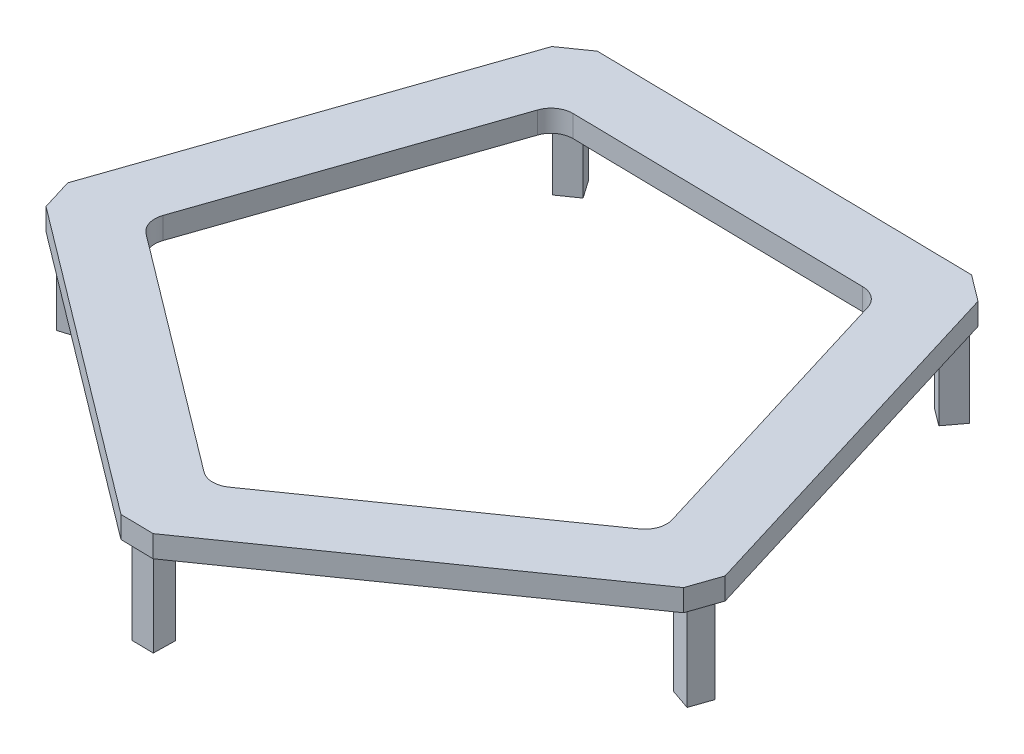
ISO-10303-21;
HEADER;
FILE_DESCRIPTION(('STEP AP214'),'2;1');
FILE_NAME('part.step','',(''),(''),'','','');
FILE_SCHEMA(('AUTOMOTIVE_DESIGN { 1 0 10303 214 1 1 1 1 }'));
ENDSEC;
DATA;
#1=APPLICATION_CONTEXT('core data for automotive mechanical design processes');
#2=APPLICATION_PROTOCOL_DEFINITION('international standard','automotive_design',2000,#1);
#3=PRODUCT_CONTEXT('',#1,'mechanical');
#4=PRODUCT('Part','Part','',(#3));
#5=PRODUCT_RELATED_PRODUCT_CATEGORY('part','',(#4));
#6=PRODUCT_DEFINITION_FORMATION('','',#4);
#7=PRODUCT_DEFINITION_CONTEXT('part definition',#1,'design');
#8=PRODUCT_DEFINITION('design','',#6,#7);
#9=PRODUCT_DEFINITION_SHAPE('','',#8);
#10=(LENGTH_UNIT() NAMED_UNIT(*) SI_UNIT(.MILLI.,.METRE.));
#11=(NAMED_UNIT(*) PLANE_ANGLE_UNIT() SI_UNIT($,.RADIAN.));
#12=(NAMED_UNIT(*) SI_UNIT($,.STERADIAN.) SOLID_ANGLE_UNIT());
#13=UNCERTAINTY_MEASURE_WITH_UNIT(LENGTH_MEASURE(1.E-05),#10,'distance_accuracy_value','');
#14=(GEOMETRIC_REPRESENTATION_CONTEXT(3) GLOBAL_UNCERTAINTY_ASSIGNED_CONTEXT((#13)) GLOBAL_UNIT_ASSIGNED_CONTEXT((#10,
#11,#12)) REPRESENTATION_CONTEXT('',''));
#15=CARTESIAN_POINT('',(0.,0.,0.));
#16=DIRECTION('',(0.,0.,1.));
#17=DIRECTION('',(1.,0.,0.));
#18=AXIS2_PLACEMENT_3D('',#15,#16,#17);
#19=CARTESIAN_POINT('',(0.,0.,0.));
#20=DIRECTION('',(0.,-1.,0.));
#21=DIRECTION('',(0.,0.,-1.));
#22=AXIS2_PLACEMENT_3D('',#19,#20,#21);
#23=PLANE('',#22);
#24=DIRECTION('',(-0.601815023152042,0.,0.798635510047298));
#25=VECTOR('',#24,1.);
#26=CARTESIAN_POINT('',(62.3425402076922,0.,-77.4556377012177));
#27=LINE('',#26,#25);
#28=CARTESIAN_POINT('',(62.3425402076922,0.,-77.4556377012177));
#29=VERTEX_POINT('',#28);
#30=CARTESIAN_POINT('',(58.5210148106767,0.,-72.3843022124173));
#31=VERTEX_POINT('',#30);
#32=EDGE_CURVE('E318',#29,#31,#27,.T.);
#33=ORIENTED_EDGE('',*,*,#32,.F.);
#34=DIRECTION('',(0.798635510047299,0.,0.60181502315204));
#35=VECTOR('',#34,1.);
#36=CARTESIAN_POINT('',(57.2712047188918,0.,-81.2771630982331));
#37=LINE('',#36,#35);
#38=CARTESIAN_POINT('',(57.2712047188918,0.,-81.2771630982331));
#39=VERTEX_POINT('',#38);
#40=EDGE_CURVE('E315',#39,#29,#37,.T.);
#41=ORIENTED_EDGE('',*,*,#40,.F.);
#42=DIRECTION('',(0.601815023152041,0.,-0.798635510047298));
#43=VECTOR('',#42,1.);
#44=CARTESIAN_POINT('',(57.2712047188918,0.,-81.2771630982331));
#45=LINE('',#44,#43);
#46=CARTESIAN_POINT('',(53.4496793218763,0.,-76.2058276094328));
#47=VERTEX_POINT('',#46);
#48=EDGE_CURVE('E328',#47,#39,#45,.T.);
#49=ORIENTED_EDGE('',*,*,#48,.F.);
#50=DIRECTION('',(-0.798635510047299,0.,-0.60181502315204));
#51=VECTOR('',#50,1.);
#52=CARTESIAN_POINT('',(53.4496793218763,0.,-76.2058276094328));
#53=LINE('',#52,#51);
#54=EDGE_CURVE('E336',#31,#47,#53,.T.);
#55=ORIENTED_EDGE('',*,*,#54,.F.);
#56=EDGE_LOOP('',(#33,#41,#49,#55));
#57=FACE_BOUND('',#56,.T.);
#58=DIRECTION('',(0.292371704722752,0.,0.956304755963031));
#59=VECTOR('',#58,1.);
#60=CARTESIAN_POINT('',(-89.8909208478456,0.,24.1623411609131));
#61=LINE('',#60,#59);
#62=CARTESIAN_POINT('',(-89.8909208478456,0.,24.1623411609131));
#63=VERTEX_POINT('',#62);
#64=CARTESIAN_POINT('',(-88.0343605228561,0.,30.2348763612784));
#65=VERTEX_POINT('',#64);
#66=EDGE_CURVE('E392',#63,#65,#61,.T.);
#67=ORIENTED_EDGE('',*,*,#66,.F.);
#68=DIRECTION('',(0.956304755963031,0.,-0.292371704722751));
#69=VECTOR('',#68,1.);
#70=CARTESIAN_POINT('',(-95.9634560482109,0.,26.0189014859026));
#71=LINE('',#70,#69);
#72=CARTESIAN_POINT('',(-95.9634560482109,0.,26.0189014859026));
#73=VERTEX_POINT('',#72);
#74=EDGE_CURVE('E378',#73,#63,#71,.T.);
#75=ORIENTED_EDGE('',*,*,#74,.F.);
#76=DIRECTION('',(-0.292371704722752,0.,-0.956304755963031));
#77=VECTOR('',#76,1.);
#78=CARTESIAN_POINT('',(-95.9634560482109,0.,26.0189014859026));
#79=LINE('',#78,#77);
#80=CARTESIAN_POINT('',(-94.1068957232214,0.,32.0914366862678));
#81=VERTEX_POINT('',#80);
#82=EDGE_CURVE('E383',#81,#73,#79,.T.);
#83=ORIENTED_EDGE('',*,*,#82,.F.);
#84=DIRECTION('',(-0.956304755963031,0.,0.292371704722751));
#85=VECTOR('',#84,1.);
#86=CARTESIAN_POINT('',(-94.1068957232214,0.,32.0914366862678));
#87=LINE('',#86,#85);
#88=EDGE_CURVE('E394',#65,#81,#87,.T.);
#89=ORIENTED_EDGE('',*,*,#88,.F.);
#90=EDGE_LOOP('',(#67,#75,#83,#89));
#91=FACE_BOUND('',#90,.T.);
#92=DIRECTION('',(0.819152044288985,0.,-0.573576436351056));
#93=VECTOR('',#92,1.);
#94=CARTESIAN_POINT('',(93.9137646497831,0.,37.374020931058));
#95=LINE('',#94,#93);
#96=CARTESIAN_POINT('',(2.99969243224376,0.,101.032739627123));
#97=VERTEX_POINT('',#96);
#98=CARTESIAN_POINT('',(93.9137646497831,0.,37.374020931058));
#99=VERTEX_POINT('',#98);
#100=EDGE_CURVE('E436',#97,#99,#95,.T.);
#101=ORIENTED_EDGE('',*,*,#100,.F.);
#102=DIRECTION('',(0.999847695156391,0.,0.017452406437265));
#103=VECTOR('',#102,1.);
#104=CARTESIAN_POINT('',(2.99969243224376,0.,101.032739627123));
#105=LINE('',#104,#103);
#106=CARTESIAN_POINT('',(-6.52385686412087,0.,100.866505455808));
#107=VERTEX_POINT('',#106);
#108=EDGE_CURVE('E441',#107,#97,#105,.T.);
#109=ORIENTED_EDGE('',*,*,#108,.F.);
#110=DIRECTION('',(0.798635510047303,0.,0.601815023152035));
#111=VECTOR('',#110,1.);
#112=CARTESIAN_POINT('',(-6.52385686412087,0.,100.866505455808));
#113=LINE('',#112,#111);
#114=CARTESIAN_POINT('',(-95.1608894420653,0.,34.0737105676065));
#115=VERTEX_POINT('',#114);
#116=EDGE_CURVE('E476',#115,#107,#113,.T.);
#117=ORIENTED_EDGE('',*,*,#116,.F.);
#118=DIRECTION('',(0.292371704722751,0.,0.956304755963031));
#119=VECTOR('',#118,1.);
#120=CARTESIAN_POINT('',(-95.1608894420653,0.,34.0737105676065));
#121=LINE('',#120,#119);
#122=CARTESIAN_POINT('',(-97.9457299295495,0.,24.9649077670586));
#123=VERTEX_POINT('',#122);
#124=EDGE_CURVE('E474',#123,#115,#121,.T.);
#125=ORIENTED_EDGE('',*,*,#124,.F.);
#126=DIRECTION('',(-0.325568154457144,0.,0.945518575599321));
#127=VECTOR('',#126,1.);
#128=CARTESIAN_POINT('',(-97.9457299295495,0.,24.9649077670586));
#129=LINE('',#128,#127);
#130=CARTESIAN_POINT('',(-61.8123565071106,0.,-79.9740283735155));
#131=VERTEX_POINT('',#130);
#132=EDGE_CURVE('E472',#131,#123,#129,.T.);
#133=ORIENTED_EDGE('',*,*,#132,.F.);
#134=DIRECTION('',(-0.819152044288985,0.,0.573576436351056));
#135=VECTOR('',#134,1.);
#136=CARTESIAN_POINT('',(-61.8123565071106,0.,-79.9740283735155));
#137=LINE('',#136,#135);
#138=CARTESIAN_POINT('',(-54.0099332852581,0.,-85.4373439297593));
#139=VERTEX_POINT('',#138);
#140=EDGE_CURVE('E470',#139,#131,#137,.T.);
#141=ORIENTED_EDGE('',*,*,#140,.F.);
#142=DIRECTION('',(-0.999847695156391,0.,-0.017452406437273));
#143=VECTOR('',#142,1.);
#144=CARTESIAN_POINT('',(-54.0099332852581,0.,-85.4373439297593));
#145=LINE('',#144,#143);
#146=CARTESIAN_POINT('',(56.9587521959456,0.,-83.5003783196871));
#147=VERTEX_POINT('',#146);
#148=EDGE_CURVE('E468',#147,#139,#145,.T.);
#149=ORIENTED_EDGE('',*,*,#148,.F.);
#150=DIRECTION('',(-0.798635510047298,0.,-0.601815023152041));
#151=VECTOR('',#150,1.);
#152=CARTESIAN_POINT('',(56.9587521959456,0.,-83.5003783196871));
#153=LINE('',#152,#151);
#154=CARTESIAN_POINT('',(64.5657554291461,0.,-77.7680902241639));
#155=VERTEX_POINT('',#154);
#156=EDGE_CURVE('E466',#155,#147,#153,.T.);
#157=ORIENTED_EDGE('',*,*,#156,.F.);
#158=DIRECTION('',(-0.292371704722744,0.,-0.956304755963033));
#159=VECTOR('',#158,1.);
#160=CARTESIAN_POINT('',(64.5657554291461,0.,-77.7680902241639));
#161=LINE('',#160,#159);
#162=CARTESIAN_POINT('',(97.0148013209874,0.,28.3679564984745));
#163=VERTEX_POINT('',#162);
#164=EDGE_CURVE('E464',#163,#155,#161,.T.);
#165=ORIENTED_EDGE('',*,*,#164,.F.);
#166=DIRECTION('',(0.32556815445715,0.,-0.945518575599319));
#167=VECTOR('',#166,1.);
#168=CARTESIAN_POINT('',(97.0148013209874,0.,28.3679564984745));
#169=LINE('',#168,#167);
#170=EDGE_CURVE('E462',#99,#163,#169,.T.);
#171=ORIENTED_EDGE('',*,*,#170,.F.);
#172=EDGE_LOOP('',(#101,#109,#117,#125,#133,#141,#149,#157,#165,#171));
#173=FACE_BOUND('',#172,.T.);
#174=DIRECTION('',(0.999847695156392,0.,0.0174524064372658));
#175=VECTOR('',#174,1.);
#176=CARTESIAN_POINT('',(-4.79807017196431,0.,92.9579200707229));
#177=LINE('',#176,#175);
#178=CARTESIAN_POINT('',(-4.79807017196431,0.,92.9579200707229));
#179=VERTEX_POINT('',#178);
#180=CARTESIAN_POINT('',(1.55096269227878,0.,93.0687428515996));
#181=VERTEX_POINT('',#180);
#182=EDGE_CURVE('E421',#179,#181,#177,.T.);
#183=ORIENTED_EDGE('',*,*,#182,.F.);
#184=DIRECTION('',(0.0174524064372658,0.,-0.999847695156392));
#185=VECTOR('',#184,1.);
#186=CARTESIAN_POINT('',(-4.90889295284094,0.,99.306952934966));
#187=LINE('',#186,#185);
#188=CARTESIAN_POINT('',(-4.90889295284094,0.,99.306952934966));
#189=VERTEX_POINT('',#188);
#190=EDGE_CURVE('E407',#189,#179,#187,.T.);
#191=ORIENTED_EDGE('',*,*,#190,.F.);
#192=DIRECTION('',(-0.999847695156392,0.,-0.0174524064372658));
#193=VECTOR('',#192,1.);
#194=CARTESIAN_POINT('',(-4.90889295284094,0.,99.306952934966));
#195=LINE('',#194,#193);
#196=CARTESIAN_POINT('',(1.44013991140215,0.,99.4177757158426));
#197=VERTEX_POINT('',#196);
#198=EDGE_CURVE('E412',#197,#189,#195,.T.);
#199=ORIENTED_EDGE('',*,*,#198,.F.);
#200=DIRECTION('',(-0.0174524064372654,0.,0.999847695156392));
#201=VECTOR('',#200,1.);
#202=CARTESIAN_POINT('',(1.44013991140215,0.,99.4177757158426));
#203=LINE('',#202,#201);
#204=EDGE_CURVE('E423',#181,#197,#203,.T.);
#205=ORIENTED_EDGE('',*,*,#204,.F.);
#206=EDGE_LOOP('',(#183,#191,#199,#205));
#207=FACE_BOUND('',#206,.T.);
#208=DIRECTION('',(0.573576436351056,0.,0.819152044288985));
#209=VECTOR('',#208,1.);
#210=CARTESIAN_POINT('',(-54.3997845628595,0.,-83.2263874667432));
#211=LINE('',#210,#209);
#212=CARTESIAN_POINT('',(-54.3997845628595,0.,-83.2263874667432));
#213=VERTEX_POINT('',#212);
#214=CARTESIAN_POINT('',(-50.7575741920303,0.,-78.0247719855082));
#215=VERTEX_POINT('',#214);
#216=EDGE_CURVE('E363',#213,#215,#211,.T.);
#217=ORIENTED_EDGE('',*,*,#216,.F.);
#218=DIRECTION('',(0.819152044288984,0.,-0.573576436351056));
#219=VECTOR('',#218,1.);
#220=CARTESIAN_POINT('',(-54.3997845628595,0.,-83.2263874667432));
#221=LINE('',#220,#219);
#222=CARTESIAN_POINT('',(-59.6014000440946,0.,-79.584177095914));
#223=VERTEX_POINT('',#222);
#224=EDGE_CURVE('E349',#223,#213,#221,.T.);
#225=ORIENTED_EDGE('',*,*,#224,.F.);
#226=DIRECTION('',(-0.573576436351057,0.,-0.819152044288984));
#227=VECTOR('',#226,1.);
#228=CARTESIAN_POINT('',(-59.6014000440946,0.,-79.584177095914));
#229=LINE('',#228,#227);
#230=CARTESIAN_POINT('',(-55.9591896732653,0.,-74.3825616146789));
#231=VERTEX_POINT('',#230);
#232=EDGE_CURVE('E354',#231,#223,#229,.T.);
#233=ORIENTED_EDGE('',*,*,#232,.F.);
#234=DIRECTION('',(-0.819152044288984,0.,0.573576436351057));
#235=VECTOR('',#234,1.);
#236=CARTESIAN_POINT('',(-50.7575741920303,0.,-78.0247719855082));
#237=LINE('',#236,#235);
#238=EDGE_CURVE('E365',#215,#231,#237,.T.);
#239=ORIENTED_EDGE('',*,*,#238,.F.);
#240=EDGE_LOOP('',(#217,#225,#233,#239));
#241=FACE_BOUND('',#240,.T.);
#242=DIRECTION('',(0.945518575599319,0.,0.32556815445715));
#243=VECTOR('',#242,1.);
#244=CARTESIAN_POINT('',(88.9929081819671,0.,27.2847700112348));
#245=LINE('',#244,#243);
#246=CARTESIAN_POINT('',(88.9929081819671,0.,27.2847700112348));
#247=VERTEX_POINT('',#246);
#248=CARTESIAN_POINT('',(94.9969511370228,0.,29.3521277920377));
#249=VERTEX_POINT('',#248);
#250=EDGE_CURVE('E588',#247,#249,#245,.T.);
#251=ORIENTED_EDGE('',*,*,#250,.F.);
#252=DIRECTION('',(0.325568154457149,0.,-0.945518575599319));
#253=VECTOR('',#252,1.);
#254=CARTESIAN_POINT('',(88.9929081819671,0.,27.2847700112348));
#255=LINE('',#254,#253);
#256=CARTESIAN_POINT('',(86.9255504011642,0.,33.2888129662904));
#257=VERTEX_POINT('',#256);
#258=EDGE_CURVE('E313',#257,#247,#255,.T.);
#259=ORIENTED_EDGE('',*,*,#258,.F.);
#260=DIRECTION('',(-0.945518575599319,0.,-0.32556815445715));
#261=VECTOR('',#260,1.);
#262=CARTESIAN_POINT('',(86.9255504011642,0.,33.2888129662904));
#263=LINE('',#262,#261);
#264=CARTESIAN_POINT('',(92.9295933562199,0.,35.3561707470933));
#265=VERTEX_POINT('',#264);
#266=EDGE_CURVE('E309',#265,#257,#263,.T.);
#267=ORIENTED_EDGE('',*,*,#266,.F.);
#268=DIRECTION('',(-0.32556815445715,0.,0.945518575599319));
#269=VECTOR('',#268,1.);
#270=CARTESIAN_POINT('',(94.9969511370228,0.,29.3521277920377));
#271=LINE('',#270,#269);
#272=EDGE_CURVE('E590',#249,#265,#271,.T.);
#273=ORIENTED_EDGE('',*,*,#272,.F.);
#274=EDGE_LOOP('',(#251,#259,#267,#273));
#275=FACE_BOUND('',#274,.T.);
#276=DIRECTION('',(-0.999847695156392,0.,-0.0174524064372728));
#277=VECTOR('',#276,1.);
#278=CARTESIAN_POINT('',(48.6736338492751,0.,-64.5920937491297));
#279=LINE('',#278,#277);
#280=CARTESIAN_POINT('',(44.0607914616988,0.,-64.6726112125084));
#281=VERTEX_POINT('',#280);
#282=CARTESIAN_POINT('',(-41.7769092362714,0.,-66.1709138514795));
#283=VERTEX_POINT('',#282);
#284=EDGE_CURVE('E564',#281,#283,#279,.T.);
#285=ORIENTED_EDGE('',*,*,#284,.T.);
#286=CARTESIAN_POINT('',(-41.8877320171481,0.,-59.8218809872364));
#287=DIRECTION('',(0.,-1.,0.));
#288=DIRECTION('',(0.,0.,-1.));
#289=AXIS2_PLACEMENT_3D('',#286,#287,#288);
#290=CIRCLE('',#289,6.35);
#291=CARTESIAN_POINT('',(-47.8917749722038,0.,-61.8892387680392));
#292=VERTEX_POINT('',#291);
#293=EDGE_CURVE('E11',#283,#292,#290,.F.);
#294=ORIENTED_EDGE('',*,*,#293,.T.);
#295=DIRECTION('',(-0.325568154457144,0.,0.945518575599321));
#296=VECTOR('',#295,1.);
#297=CARTESIAN_POINT('',(-46.3897516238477,0.,-66.2514313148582));
#298=LINE('',#297,#296);
#299=CARTESIAN_POINT('',(-75.8420537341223,0.,19.2842648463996));
#300=VERTEX_POINT('',#299);
#301=EDGE_CURVE('E562',#292,#300,#298,.T.);
#302=ORIENTED_EDGE('',*,*,#301,.T.);
#303=CARTESIAN_POINT('',(-69.8380107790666,0.,21.3516226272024));
#304=DIRECTION('',(0.,-1.,0.));
#305=DIRECTION('',(0.,0.,-1.));
#306=AXIS2_PLACEMENT_3D('',#303,#304,#305);
#307=CIRCLE('',#306,6.35);
#308=CARTESIAN_POINT('',(-73.659536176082,0.,26.4229581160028));
#309=VERTEX_POINT('',#308);
#310=EDGE_CURVE('E545',#300,#309,#307,.F.);
#311=ORIENTED_EDGE('',*,*,#310,.T.);
#312=DIRECTION('',(0.798635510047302,0.,0.601815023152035));
#313=VECTOR('',#312,1.);
#314=CARTESIAN_POINT('',(-77.3440770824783,0.,23.6464573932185));
#315=LINE('',#314,#313);
#316=CARTESIAN_POINT('',(-5.0960577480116,0.,78.0892449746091));
#317=VERTEX_POINT('',#316);
#318=EDGE_CURVE('E568',#309,#317,#315,.T.);
#319=ORIENTED_EDGE('',*,*,#318,.T.);
#320=CARTESIAN_POINT('',(-1.27453235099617,0.,73.0179094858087));
#321=DIRECTION('',(0.,-1.,0.));
#322=DIRECTION('',(0.,0.,-1.));
#323=AXIS2_PLACEMENT_3D('',#320,#321,#322);
#324=CIRCLE('',#323,6.35);
#325=CARTESIAN_POINT('',(2.36767801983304,0.,78.2195249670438));
#326=VERTEX_POINT('',#325);
#327=EDGE_CURVE('E538',#317,#326,#324,.F.);
#328=ORIENTED_EDGE('',*,*,#327,.T.);
#329=DIRECTION('',(0.819152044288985,0.,-0.573576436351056));
#330=VECTOR('',#329,1.);
#331=CARTESIAN_POINT('',(-1.41151684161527,0.,80.8657456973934));
#332=LINE('',#331,#330);
#333=CARTESIAN_POINT('',(72.6925168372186,0.,28.9775427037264));
#334=VERTEX_POINT('',#333);
#335=EDGE_CURVE('E572',#326,#334,#332,.T.);
#336=ORIENTED_EDGE('',*,*,#335,.T.);
#337=CARTESIAN_POINT('',(69.0503064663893,0.,23.7759272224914));
#338=DIRECTION('',(0.,-1.,0.));
#339=DIRECTION('',(0.,0.,-1.));
#340=AXIS2_PLACEMENT_3D('',#337,#338,#339);
#341=CIRCLE('',#340,6.35);
#342=CARTESIAN_POINT('',(75.1228416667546,0.,21.9193668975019));
#343=VERTEX_POINT('',#342);
#344=EDGE_CURVE('E542',#334,#343,#341,.F.);
#345=ORIENTED_EDGE('',*,*,#344,.T.);
#346=DIRECTION('',(-0.292371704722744,0.,-0.956304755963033));
#347=VECTOR('',#346,1.);
#348=CARTESIAN_POINT('',(76.4717116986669,0.,26.3313219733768));
#349=LINE('',#348,#347);
#350=CARTESIAN_POINT('',(50.0225038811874,0.,-60.1801386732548));
#351=VERTEX_POINT('',#350);
#352=EDGE_CURVE('E579',#343,#351,#349,.T.);
#353=ORIENTED_EDGE('',*,*,#352,.T.);
#354=CARTESIAN_POINT('',(43.9499686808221,0.,-58.3235783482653));
#355=DIRECTION('',(0.,-1.,0.));
#356=DIRECTION('',(0.,0.,-1.));
#357=AXIS2_PLACEMENT_3D('',#354,#355,#356);
#358=CIRCLE('',#357,6.35);
#359=EDGE_CURVE('E534',#351,#281,#358,.F.);
#360=ORIENTED_EDGE('',*,*,#359,.T.);
#361=EDGE_LOOP('',(#285,#294,#302,#311,#319,#328,#336,#345,#353,#360));
#362=FACE_BOUND('',#361,.T.);
#363=ADVANCED_FACE('F33',(#57,#91,#173,#207,#241,#275,#362),#23,.T.);
#364=CARTESIAN_POINT('',(0.,6.35,0.));
#365=DIRECTION('',(0.,-1.,0.));
#366=DIRECTION('',(0.,0.,-1.));
#367=AXIS2_PLACEMENT_3D('',#364,#365,#366);
#368=PLANE('',#367);
#369=DIRECTION('',(0.819152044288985,0.,-0.573576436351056));
#370=VECTOR('',#369,1.);
#371=CARTESIAN_POINT('',(93.9137646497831,6.35,37.374020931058));
#372=LINE('',#371,#370);
#373=CARTESIAN_POINT('',(2.99969243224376,6.35,101.032739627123));
#374=VERTEX_POINT('',#373);
#375=CARTESIAN_POINT('',(93.9137646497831,6.35,37.374020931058));
#376=VERTEX_POINT('',#375);
#377=EDGE_CURVE('E437',#374,#376,#372,.T.);
#378=ORIENTED_EDGE('',*,*,#377,.T.);
#379=DIRECTION('',(0.32556815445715,0.,-0.945518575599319));
#380=VECTOR('',#379,1.);
#381=CARTESIAN_POINT('',(97.0148013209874,6.35,28.3679564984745));
#382=LINE('',#381,#380);
#383=CARTESIAN_POINT('',(97.0148013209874,6.35,28.3679564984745));
#384=VERTEX_POINT('',#383);
#385=EDGE_CURVE('E440',#376,#384,#382,.T.);
#386=ORIENTED_EDGE('',*,*,#385,.T.);
#387=DIRECTION('',(-0.292371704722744,0.,-0.956304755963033));
#388=VECTOR('',#387,1.);
#389=CARTESIAN_POINT('',(64.5657554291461,6.35,-77.7680902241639));
#390=LINE('',#389,#388);
#391=CARTESIAN_POINT('',(64.5657554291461,6.35,-77.7680902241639));
#392=VERTEX_POINT('',#391);
#393=EDGE_CURVE('E443',#384,#392,#390,.T.);
#394=ORIENTED_EDGE('',*,*,#393,.T.);
#395=DIRECTION('',(-0.798635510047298,0.,-0.601815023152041));
#396=VECTOR('',#395,1.);
#397=CARTESIAN_POINT('',(56.9587521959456,6.35,-83.5003783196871));
#398=LINE('',#397,#396);
#399=CARTESIAN_POINT('',(56.9587521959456,6.35,-83.5003783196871));
#400=VERTEX_POINT('',#399);
#401=EDGE_CURVE('E445',#392,#400,#398,.T.);
#402=ORIENTED_EDGE('',*,*,#401,.T.);
#403=DIRECTION('',(-0.999847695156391,0.,-0.017452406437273));
#404=VECTOR('',#403,1.);
#405=CARTESIAN_POINT('',(-54.0099332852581,6.35,-85.4373439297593));
#406=LINE('',#405,#404);
#407=CARTESIAN_POINT('',(-54.0099332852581,6.35,-85.4373439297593));
#408=VERTEX_POINT('',#407);
#409=EDGE_CURVE('E447',#400,#408,#406,.T.);
#410=ORIENTED_EDGE('',*,*,#409,.T.);
#411=DIRECTION('',(-0.819152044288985,0.,0.573576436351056));
#412=VECTOR('',#411,1.);
#413=CARTESIAN_POINT('',(-61.8123565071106,6.35,-79.9740283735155));
#414=LINE('',#413,#412);
#415=CARTESIAN_POINT('',(-61.8123565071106,6.35,-79.9740283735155));
#416=VERTEX_POINT('',#415);
#417=EDGE_CURVE('E449',#408,#416,#414,.T.);
#418=ORIENTED_EDGE('',*,*,#417,.T.);
#419=DIRECTION('',(-0.325568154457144,0.,0.945518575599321));
#420=VECTOR('',#419,1.);
#421=CARTESIAN_POINT('',(-97.9457299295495,6.35,24.9649077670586));
#422=LINE('',#421,#420);
#423=CARTESIAN_POINT('',(-97.9457299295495,6.35,24.9649077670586));
#424=VERTEX_POINT('',#423);
#425=EDGE_CURVE('E451',#416,#424,#422,.T.);
#426=ORIENTED_EDGE('',*,*,#425,.T.);
#427=DIRECTION('',(0.292371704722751,0.,0.956304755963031));
#428=VECTOR('',#427,1.);
#429=CARTESIAN_POINT('',(-95.1608894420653,6.35,34.0737105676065));
#430=LINE('',#429,#428);
#431=CARTESIAN_POINT('',(-95.1608894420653,6.35,34.0737105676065));
#432=VERTEX_POINT('',#431);
#433=EDGE_CURVE('E453',#424,#432,#430,.T.);
#434=ORIENTED_EDGE('',*,*,#433,.T.);
#435=DIRECTION('',(0.798635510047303,0.,0.601815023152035));
#436=VECTOR('',#435,1.);
#437=CARTESIAN_POINT('',(-6.52385686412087,6.35,100.866505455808));
#438=LINE('',#437,#436);
#439=CARTESIAN_POINT('',(-6.52385686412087,6.35,100.866505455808));
#440=VERTEX_POINT('',#439);
#441=EDGE_CURVE('E455',#432,#440,#438,.T.);
#442=ORIENTED_EDGE('',*,*,#441,.T.);
#443=DIRECTION('',(0.999847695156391,0.,0.017452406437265));
#444=VECTOR('',#443,1.);
#445=CARTESIAN_POINT('',(2.99969243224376,6.35,101.032739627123));
#446=LINE('',#445,#444);
#447=EDGE_CURVE('E457',#440,#374,#446,.T.);
#448=ORIENTED_EDGE('',*,*,#447,.T.);
#449=EDGE_LOOP('',(#378,#386,#394,#402,#410,#418,#426,#434,#442,#448));
#450=FACE_BOUND('',#449,.T.);
#451=DIRECTION('',(0.798635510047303,0.,0.601815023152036));
#452=VECTOR('',#451,1.);
#453=CARTESIAN_POINT('',(-77.3440770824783,6.35,23.6464573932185));
#454=LINE('',#453,#452);
#455=CARTESIAN_POINT('',(-73.659536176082,6.35,26.4229581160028));
#456=VERTEX_POINT('',#455);
#457=CARTESIAN_POINT('',(-5.09605774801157,6.35,78.0892449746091));
#458=VERTEX_POINT('',#457);
#459=EDGE_CURVE('E680',#456,#458,#454,.T.);
#460=ORIENTED_EDGE('',*,*,#459,.F.);
#461=CARTESIAN_POINT('',(-69.8380107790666,6.34999999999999,21.3516226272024));
#462=DIRECTION('',(0.,-1.,0.));
#463=DIRECTION('',(0.,0.,-1.));
#464=AXIS2_PLACEMENT_3D('',#461,#462,#463);
#465=CIRCLE('',#464,6.35);
#466=CARTESIAN_POINT('',(-75.8420537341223,6.35,19.2842648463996));
#467=VERTEX_POINT('',#466);
#468=EDGE_CURVE('E48',#456,#467,#465,.T.);
#469=ORIENTED_EDGE('',*,*,#468,.T.);
#470=DIRECTION('',(-0.325568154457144,0.,0.945518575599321));
#471=VECTOR('',#470,1.);
#472=CARTESIAN_POINT('',(-46.3897516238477,6.35,-66.2514313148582));
#473=LINE('',#472,#471);
#474=CARTESIAN_POINT('',(-47.8917749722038,6.35,-61.8892387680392));
#475=VERTEX_POINT('',#474);
#476=EDGE_CURVE('E550',#475,#467,#473,.T.);
#477=ORIENTED_EDGE('',*,*,#476,.F.);
#478=CARTESIAN_POINT('',(-41.8877320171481,6.34999999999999,-59.8218809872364));
#479=DIRECTION('',(0.,-1.,0.));
#480=DIRECTION('',(0.,0.,-1.));
#481=AXIS2_PLACEMENT_3D('',#478,#479,#480);
#482=CIRCLE('',#481,6.35);
#483=CARTESIAN_POINT('',(-41.7769092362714,6.35,-66.1709138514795));
#484=VERTEX_POINT('',#483);
#485=EDGE_CURVE('E41',#475,#484,#482,.T.);
#486=ORIENTED_EDGE('',*,*,#485,.T.);
#487=DIRECTION('',(-0.999847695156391,0.,-0.0174524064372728));
#488=VECTOR('',#487,1.);
#489=CARTESIAN_POINT('',(48.6736338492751,6.35,-64.5920937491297));
#490=LINE('',#489,#488);
#491=CARTESIAN_POINT('',(44.0607914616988,6.35,-64.6726112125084));
#492=VERTEX_POINT('',#491);
#493=EDGE_CURVE('E549',#492,#484,#490,.T.);
#494=ORIENTED_EDGE('',*,*,#493,.F.);
#495=CARTESIAN_POINT('',(43.9499686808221,6.34999999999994,-58.3235783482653));
#496=DIRECTION('',(0.,-1.,0.));
#497=DIRECTION('',(0.,0.,-1.));
#498=AXIS2_PLACEMENT_3D('',#495,#496,#497);
#499=CIRCLE('',#498,6.35);
#500=CARTESIAN_POINT('',(50.0225038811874,6.35,-60.1801386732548));
#501=VERTEX_POINT('',#500);
#502=EDGE_CURVE('E532',#492,#501,#499,.T.);
#503=ORIENTED_EDGE('',*,*,#502,.T.);
#504=DIRECTION('',(-0.292371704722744,0.,-0.956304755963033));
#505=VECTOR('',#504,1.);
#506=CARTESIAN_POINT('',(76.4717116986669,6.35,26.3313219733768));
#507=LINE('',#506,#505);
#508=CARTESIAN_POINT('',(75.1228416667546,6.35,21.9193668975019));
#509=VERTEX_POINT('',#508);
#510=EDGE_CURVE('E556',#509,#501,#507,.T.);
#511=ORIENTED_EDGE('',*,*,#510,.F.);
#512=CARTESIAN_POINT('',(69.0503064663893,6.34999999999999,23.7759272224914));
#513=DIRECTION('',(0.,-1.,0.));
#514=DIRECTION('',(0.,0.,-1.));
#515=AXIS2_PLACEMENT_3D('',#512,#513,#514);
#516=CIRCLE('',#515,6.35);
#517=CARTESIAN_POINT('',(72.6925168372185,6.35,28.9775427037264));
#518=VERTEX_POINT('',#517);
#519=EDGE_CURVE('E540',#509,#518,#516,.T.);
#520=ORIENTED_EDGE('',*,*,#519,.T.);
#521=DIRECTION('',(0.819152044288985,0.,-0.573576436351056));
#522=VECTOR('',#521,1.);
#523=CARTESIAN_POINT('',(-1.41151684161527,6.35,80.8657456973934));
#524=LINE('',#523,#522);
#525=CARTESIAN_POINT('',(2.36767801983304,6.35,78.2195249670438));
#526=VERTEX_POINT('',#525);
#527=EDGE_CURVE('E569',#526,#518,#524,.T.);
#528=ORIENTED_EDGE('',*,*,#527,.F.);
#529=CARTESIAN_POINT('',(-1.27453235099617,6.34999999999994,73.0179094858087));
#530=DIRECTION('',(0.,-1.,0.));
#531=DIRECTION('',(0.,0.,-1.));
#532=AXIS2_PLACEMENT_3D('',#529,#530,#531);
#533=CIRCLE('',#532,6.35);
#534=EDGE_CURVE('E536',#526,#458,#533,.T.);
#535=ORIENTED_EDGE('',*,*,#534,.T.);
#536=EDGE_LOOP('',(#460,#469,#477,#486,#494,#503,#511,#520,#528,#535));
#537=FACE_BOUND('',#536,.T.);
#538=ADVANCED_FACE('F548',(#450,#537),#368,.F.);
#539=CARTESIAN_POINT('',(93.9137646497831,6.35,37.374020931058));
#540=DIRECTION('',(-0.573576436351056,0.,-0.819152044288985));
#541=DIRECTION('',(-0.819152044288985,0.,0.573576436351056));
#542=AXIS2_PLACEMENT_3D('',#539,#540,#541);
#543=PLANE('',#542);
#544=ORIENTED_EDGE('',*,*,#100,.T.);
#545=DIRECTION('',(0.,-1.,0.));
#546=VECTOR('',#545,1.);
#547=CARTESIAN_POINT('',(93.9137646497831,6.35,37.374020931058));
#548=LINE('',#547,#546);
#549=EDGE_CURVE('E505',#376,#99,#548,.T.);
#550=ORIENTED_EDGE('',*,*,#549,.F.);
#551=ORIENTED_EDGE('',*,*,#377,.F.);
#552=DIRECTION('',(0.,-1.,0.));
#553=VECTOR('',#552,1.);
#554=CARTESIAN_POINT('',(2.99969243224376,6.35,101.032739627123));
#555=LINE('',#554,#553);
#556=EDGE_CURVE('E459',#374,#97,#555,.T.);
#557=ORIENTED_EDGE('',*,*,#556,.T.);
#558=EDGE_LOOP('',(#544,#550,#551,#557));
#559=FACE_BOUND('',#558,.T.);
#560=ADVANCED_FACE('F608',(#559),#543,.F.);
#561=CARTESIAN_POINT('',(97.0148013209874,6.35,28.3679564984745));
#562=DIRECTION('',(-0.945518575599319,0.,-0.32556815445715));
#563=DIRECTION('',(-0.32556815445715,0.,0.945518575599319));
#564=AXIS2_PLACEMENT_3D('',#561,#562,#563);
#565=PLANE('',#564);
#566=ORIENTED_EDGE('',*,*,#170,.T.);
#567=DIRECTION('',(0.,-1.,0.));
#568=VECTOR('',#567,1.);
#569=CARTESIAN_POINT('',(97.0148013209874,6.35,28.3679564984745));
#570=LINE('',#569,#568);
#571=EDGE_CURVE('E502',#384,#163,#570,.T.);
#572=ORIENTED_EDGE('',*,*,#571,.F.);
#573=ORIENTED_EDGE('',*,*,#385,.F.);
#574=ORIENTED_EDGE('',*,*,#549,.T.);
#575=EDGE_LOOP('',(#566,#572,#573,#574));
#576=FACE_BOUND('',#575,.T.);
#577=ADVANCED_FACE('F647',(#576),#565,.F.);
#578=CARTESIAN_POINT('',(64.5657554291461,6.35,-77.7680902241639));
#579=DIRECTION('',(-0.956304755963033,0.,0.292371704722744));
#580=DIRECTION('',(0.292371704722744,0.,0.956304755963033));
#581=AXIS2_PLACEMENT_3D('',#578,#579,#580);
#582=PLANE('',#581);
#583=ORIENTED_EDGE('',*,*,#164,.T.);
#584=DIRECTION('',(0.,-1.,0.));
#585=VECTOR('',#584,1.);
#586=CARTESIAN_POINT('',(64.5657554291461,6.35,-77.7680902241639));
#587=LINE('',#586,#585);
#588=EDGE_CURVE('E499',#392,#155,#587,.T.);
#589=ORIENTED_EDGE('',*,*,#588,.F.);
#590=ORIENTED_EDGE('',*,*,#393,.F.);
#591=ORIENTED_EDGE('',*,*,#571,.T.);
#592=EDGE_LOOP('',(#583,#589,#590,#591));
#593=FACE_BOUND('',#592,.T.);
#594=ADVANCED_FACE('F643',(#593),#582,.F.);
#595=CARTESIAN_POINT('',(56.9587521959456,6.35,-83.5003783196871));
#596=DIRECTION('',(-0.601815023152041,0.,0.798635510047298));
#597=DIRECTION('',(0.798635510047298,0.,0.601815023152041));
#598=AXIS2_PLACEMENT_3D('',#595,#596,#597);
#599=PLANE('',#598);
#600=ORIENTED_EDGE('',*,*,#156,.T.);
#601=DIRECTION('',(0.,-1.,0.));
#602=VECTOR('',#601,1.);
#603=CARTESIAN_POINT('',(56.9587521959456,6.35,-83.5003783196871));
#604=LINE('',#603,#602);
#605=EDGE_CURVE('E496',#400,#147,#604,.T.);
#606=ORIENTED_EDGE('',*,*,#605,.F.);
#607=ORIENTED_EDGE('',*,*,#401,.F.);
#608=ORIENTED_EDGE('',*,*,#588,.T.);
#609=EDGE_LOOP('',(#600,#606,#607,#608));
#610=FACE_BOUND('',#609,.T.);
#611=ADVANCED_FACE('F639',(#610),#599,.F.);
#612=CARTESIAN_POINT('',(-54.0099332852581,6.35,-85.4373439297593));
#613=DIRECTION('',(-0.017452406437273,0.,0.999847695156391));
#614=DIRECTION('',(0.999847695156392,0.,0.017452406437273));
#615=AXIS2_PLACEMENT_3D('',#612,#613,#614);
#616=PLANE('',#615);
#617=ORIENTED_EDGE('',*,*,#148,.T.);
#618=DIRECTION('',(0.,-1.,0.));
#619=VECTOR('',#618,1.);
#620=CARTESIAN_POINT('',(-54.0099332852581,6.35,-85.4373439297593));
#621=LINE('',#620,#619);
#622=EDGE_CURVE('E493',#408,#139,#621,.T.);
#623=ORIENTED_EDGE('',*,*,#622,.F.);
#624=ORIENTED_EDGE('',*,*,#409,.F.);
#625=ORIENTED_EDGE('',*,*,#605,.T.);
#626=EDGE_LOOP('',(#617,#623,#624,#625));
#627=FACE_BOUND('',#626,.T.);
#628=ADVANCED_FACE('F635',(#627),#616,.F.);
#629=CARTESIAN_POINT('',(-61.8123565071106,6.35,-79.9740283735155));
#630=DIRECTION('',(0.573576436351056,0.,0.819152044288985));
#631=DIRECTION('',(0.819152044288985,0.,-0.573576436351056));
#632=AXIS2_PLACEMENT_3D('',#629,#630,#631);
#633=PLANE('',#632);
#634=ORIENTED_EDGE('',*,*,#140,.T.);
#635=DIRECTION('',(0.,-1.,0.));
#636=VECTOR('',#635,1.);
#637=CARTESIAN_POINT('',(-61.8123565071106,6.35,-79.9740283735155));
#638=LINE('',#637,#636);
#639=EDGE_CURVE('E490',#416,#131,#638,.T.);
#640=ORIENTED_EDGE('',*,*,#639,.F.);
#641=ORIENTED_EDGE('',*,*,#417,.F.);
#642=ORIENTED_EDGE('',*,*,#622,.T.);
#643=EDGE_LOOP('',(#634,#640,#641,#642));
#644=FACE_BOUND('',#643,.T.);
#645=ADVANCED_FACE('F631',(#644),#633,.F.);
#646=CARTESIAN_POINT('',(-97.9457299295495,6.35,24.9649077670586));
#647=DIRECTION('',(0.945518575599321,0.,0.325568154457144));
#648=DIRECTION('',(0.325568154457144,0.,-0.945518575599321));
#649=AXIS2_PLACEMENT_3D('',#646,#647,#648);
#650=PLANE('',#649);
#651=ORIENTED_EDGE('',*,*,#132,.T.);
#652=DIRECTION('',(0.,-1.,0.));
#653=VECTOR('',#652,1.);
#654=CARTESIAN_POINT('',(-97.9457299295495,6.35,24.9649077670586));
#655=LINE('',#654,#653);
#656=EDGE_CURVE('E487',#424,#123,#655,.T.);
#657=ORIENTED_EDGE('',*,*,#656,.F.);
#658=ORIENTED_EDGE('',*,*,#425,.F.);
#659=ORIENTED_EDGE('',*,*,#639,.T.);
#660=EDGE_LOOP('',(#651,#657,#658,#659));
#661=FACE_BOUND('',#660,.T.);
#662=ADVANCED_FACE('F627',(#661),#650,.F.);
#663=CARTESIAN_POINT('',(-95.1608894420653,6.35,34.0737105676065));
#664=DIRECTION('',(0.956304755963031,0.,-0.292371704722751));
#665=DIRECTION('',(-0.292371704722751,0.,-0.956304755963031));
#666=AXIS2_PLACEMENT_3D('',#663,#664,#665);
#667=PLANE('',#666);
#668=ORIENTED_EDGE('',*,*,#124,.T.);
#669=DIRECTION('',(0.,-1.,0.));
#670=VECTOR('',#669,1.);
#671=CARTESIAN_POINT('',(-95.1608894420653,6.35,34.0737105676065));
#672=LINE('',#671,#670);
#673=EDGE_CURVE('E484',#432,#115,#672,.T.);
#674=ORIENTED_EDGE('',*,*,#673,.F.);
#675=ORIENTED_EDGE('',*,*,#433,.F.);
#676=ORIENTED_EDGE('',*,*,#656,.T.);
#677=EDGE_LOOP('',(#668,#674,#675,#676));
#678=FACE_BOUND('',#677,.T.);
#679=ADVANCED_FACE('F623',(#678),#667,.F.);
#680=CARTESIAN_POINT('',(-6.52385686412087,6.35,100.866505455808));
#681=DIRECTION('',(0.601815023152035,0.,-0.798635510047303));
#682=DIRECTION('',(-0.798635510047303,0.,-0.601815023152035));
#683=AXIS2_PLACEMENT_3D('',#680,#681,#682);
#684=PLANE('',#683);
#685=ORIENTED_EDGE('',*,*,#116,.T.);
#686=DIRECTION('',(0.,-1.,0.));
#687=VECTOR('',#686,1.);
#688=CARTESIAN_POINT('',(-6.52385686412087,6.35,100.866505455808));
#689=LINE('',#688,#687);
#690=EDGE_CURVE('E481',#440,#107,#689,.T.);
#691=ORIENTED_EDGE('',*,*,#690,.F.);
#692=ORIENTED_EDGE('',*,*,#441,.F.);
#693=ORIENTED_EDGE('',*,*,#673,.T.);
#694=EDGE_LOOP('',(#685,#691,#692,#693));
#695=FACE_BOUND('',#694,.T.);
#696=ADVANCED_FACE('F619',(#695),#684,.F.);
#697=CARTESIAN_POINT('',(2.99969243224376,6.35,101.032739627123));
#698=DIRECTION('',(0.017452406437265,0.,-0.999847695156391));
#699=DIRECTION('',(-0.999847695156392,0.,-0.017452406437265));
#700=AXIS2_PLACEMENT_3D('',#697,#698,#699);
#701=PLANE('',#700);
#702=ORIENTED_EDGE('',*,*,#108,.T.);
#703=ORIENTED_EDGE('',*,*,#556,.F.);
#704=ORIENTED_EDGE('',*,*,#447,.F.);
#705=ORIENTED_EDGE('',*,*,#690,.T.);
#706=EDGE_LOOP('',(#702,#703,#704,#705));
#707=FACE_BOUND('',#706,.T.);
#708=ADVANCED_FACE('F615',(#707),#701,.F.);
#709=CARTESIAN_POINT('',(-4.90889295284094,-25.4,99.306952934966));
#710=DIRECTION('',(0.999847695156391,0.,0.0174524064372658));
#711=DIRECTION('',(0.0174524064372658,0.,-0.999847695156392));
#712=AXIS2_PLACEMENT_3D('',#709,#710,#711);
#713=PLANE('',#712);
#714=ORIENTED_EDGE('',*,*,#190,.T.);
#715=DIRECTION('',(0.,1.,0.));
#716=VECTOR('',#715,1.);
#717=CARTESIAN_POINT('',(-4.79807017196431,-25.4,92.9579200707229));
#718=LINE('',#717,#716);
#719=CARTESIAN_POINT('',(-4.79807017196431,-25.4,92.9579200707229));
#720=VERTEX_POINT('',#719);
#721=EDGE_CURVE('E434',#720,#179,#718,.T.);
#722=ORIENTED_EDGE('',*,*,#721,.F.);
#723=DIRECTION('',(0.0174524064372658,0.,-0.999847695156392));
#724=VECTOR('',#723,1.);
#725=CARTESIAN_POINT('',(-4.90889295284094,-25.4,99.306952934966));
#726=LINE('',#725,#724);
#727=CARTESIAN_POINT('',(-4.90889295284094,-25.4,99.306952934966));
#728=VERTEX_POINT('',#727);
#729=EDGE_CURVE('E408',#728,#720,#726,.T.);
#730=ORIENTED_EDGE('',*,*,#729,.F.);
#731=DIRECTION('',(0.,1.,0.));
#732=VECTOR('',#731,1.);
#733=CARTESIAN_POINT('',(-4.90889295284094,-25.4,99.306952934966));
#734=LINE('',#733,#732);
#735=EDGE_CURVE('E418',#728,#189,#734,.T.);
#736=ORIENTED_EDGE('',*,*,#735,.T.);
#737=EDGE_LOOP('',(#714,#722,#730,#736));
#738=FACE_BOUND('',#737,.T.);
#739=ADVANCED_FACE('F618',(#738),#713,.F.);
#740=CARTESIAN_POINT('',(-4.79807017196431,-25.4,92.9579200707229));
#741=DIRECTION('',(-0.0174524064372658,0.,0.999847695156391));
#742=DIRECTION('',(0.999847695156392,0.,0.0174524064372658));
#743=AXIS2_PLACEMENT_3D('',#740,#741,#742);
#744=PLANE('',#743);
#745=ORIENTED_EDGE('',*,*,#182,.T.);
#746=DIRECTION('',(0.,1.,0.));
#747=VECTOR('',#746,1.);
#748=CARTESIAN_POINT('',(1.55096269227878,-25.4,93.0687428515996));
#749=LINE('',#748,#747);
#750=CARTESIAN_POINT('',(1.55096269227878,-25.4,93.0687428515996));
#751=VERTEX_POINT('',#750);
#752=EDGE_CURVE('E431',#751,#181,#749,.T.);
#753=ORIENTED_EDGE('',*,*,#752,.F.);
#754=DIRECTION('',(0.999847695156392,0.,0.0174524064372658));
#755=VECTOR('',#754,1.);
#756=CARTESIAN_POINT('',(-4.79807017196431,-25.4,92.9579200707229));
#757=LINE('',#756,#755);
#758=EDGE_CURVE('E411',#720,#751,#757,.T.);
#759=ORIENTED_EDGE('',*,*,#758,.F.);
#760=ORIENTED_EDGE('',*,*,#721,.T.);
#761=EDGE_LOOP('',(#745,#753,#759,#760));
#762=FACE_BOUND('',#761,.T.);
#763=ADVANCED_FACE('F791',(#762),#744,.F.);
#764=CARTESIAN_POINT('',(1.44013991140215,-25.4,99.4177757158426));
#765=DIRECTION('',(-0.999847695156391,0.,-0.0174524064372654));
#766=DIRECTION('',(-0.0174524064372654,0.,0.999847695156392));
#767=AXIS2_PLACEMENT_3D('',#764,#765,#766);
#768=PLANE('',#767);
#769=ORIENTED_EDGE('',*,*,#204,.T.);
#770=DIRECTION('',(0.,1.,0.));
#771=VECTOR('',#770,1.);
#772=CARTESIAN_POINT('',(1.44013991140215,-25.4,99.4177757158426));
#773=LINE('',#772,#771);
#774=CARTESIAN_POINT('',(1.44013991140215,-25.4,99.4177757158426));
#775=VERTEX_POINT('',#774);
#776=EDGE_CURVE('E429',#775,#197,#773,.T.);
#777=ORIENTED_EDGE('',*,*,#776,.F.);
#778=DIRECTION('',(-0.0174524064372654,0.,0.999847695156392));
#779=VECTOR('',#778,1.);
#780=CARTESIAN_POINT('',(1.44013991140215,-25.4,99.4177757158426));
#781=LINE('',#780,#779);
#782=EDGE_CURVE('E414',#751,#775,#781,.T.);
#783=ORIENTED_EDGE('',*,*,#782,.F.);
#784=ORIENTED_EDGE('',*,*,#752,.T.);
#785=EDGE_LOOP('',(#769,#777,#783,#784));
#786=FACE_BOUND('',#785,.T.);
#787=ADVANCED_FACE('F787',(#786),#768,.F.);
#788=CARTESIAN_POINT('',(-4.90889295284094,-25.4,99.306952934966));
#789=DIRECTION('',(0.0174524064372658,0.,-0.999847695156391));
#790=DIRECTION('',(-0.999847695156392,0.,-0.0174524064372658));
#791=AXIS2_PLACEMENT_3D('',#788,#789,#790);
#792=PLANE('',#791);
#793=ORIENTED_EDGE('',*,*,#198,.T.);
#794=ORIENTED_EDGE('',*,*,#735,.F.);
#795=DIRECTION('',(-0.999847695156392,0.,-0.0174524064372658));
#796=VECTOR('',#795,1.);
#797=CARTESIAN_POINT('',(-4.90889295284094,-25.4,99.306952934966));
#798=LINE('',#797,#796);
#799=EDGE_CURVE('E416',#775,#728,#798,.T.);
#800=ORIENTED_EDGE('',*,*,#799,.F.);
#801=ORIENTED_EDGE('',*,*,#776,.T.);
#802=EDGE_LOOP('',(#793,#794,#800,#801));
#803=FACE_BOUND('',#802,.T.);
#804=ADVANCED_FACE('F783',(#803),#792,.F.);
#805=CARTESIAN_POINT('',(0.,-25.4,0.));
#806=DIRECTION('',(0.,-1.,0.));
#807=DIRECTION('',(0.,0.,-1.));
#808=AXIS2_PLACEMENT_3D('',#805,#806,#807);
#809=PLANE('',#808);
#810=ORIENTED_EDGE('',*,*,#729,.T.);
#811=ORIENTED_EDGE('',*,*,#758,.T.);
#812=ORIENTED_EDGE('',*,*,#782,.T.);
#813=ORIENTED_EDGE('',*,*,#799,.T.);
#814=EDGE_LOOP('',(#810,#811,#812,#813));
#815=FACE_BOUND('',#814,.T.);
#816=ADVANCED_FACE('F779',(#815),#809,.T.);
#817=CARTESIAN_POINT('',(-95.9634560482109,-25.4,26.0189014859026));
#818=DIRECTION('',(0.292371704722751,0.,0.956304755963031));
#819=DIRECTION('',(0.956304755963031,0.,-0.292371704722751));
#820=AXIS2_PLACEMENT_3D('',#817,#818,#819);
#821=PLANE('',#820);
#822=ORIENTED_EDGE('',*,*,#74,.T.);
#823=DIRECTION('',(0.,1.,0.));
#824=VECTOR('',#823,1.);
#825=CARTESIAN_POINT('',(-89.8909208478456,-25.4,24.1623411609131));
#826=LINE('',#825,#824);
#827=CARTESIAN_POINT('',(-89.8909208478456,-25.4,24.1623411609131));
#828=VERTEX_POINT('',#827);
#829=EDGE_CURVE('E405',#828,#63,#826,.T.);
#830=ORIENTED_EDGE('',*,*,#829,.F.);
#831=DIRECTION('',(0.956304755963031,0.,-0.292371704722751));
#832=VECTOR('',#831,1.);
#833=CARTESIAN_POINT('',(-95.9634560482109,-25.4,26.0189014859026));
#834=LINE('',#833,#832);
#835=CARTESIAN_POINT('',(-95.9634560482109,-25.4,26.0189014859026));
#836=VERTEX_POINT('',#835);
#837=EDGE_CURVE('E379',#836,#828,#834,.T.);
#838=ORIENTED_EDGE('',*,*,#837,.F.);
#839=DIRECTION('',(0.,1.,0.));
#840=VECTOR('',#839,1.);
#841=CARTESIAN_POINT('',(-95.9634560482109,-25.4,26.0189014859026));
#842=LINE('',#841,#840);
#843=EDGE_CURVE('E389',#836,#73,#842,.T.);
#844=ORIENTED_EDGE('',*,*,#843,.T.);
#845=EDGE_LOOP('',(#822,#830,#838,#844));
#846=FACE_BOUND('',#845,.T.);
#847=ADVANCED_FACE('F775',(#846),#821,.F.);
#848=CARTESIAN_POINT('',(-89.8909208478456,-25.4,24.1623411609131));
#849=DIRECTION('',(-0.956304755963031,0.,0.292371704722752));
#850=DIRECTION('',(0.292371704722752,0.,0.956304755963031));
#851=AXIS2_PLACEMENT_3D('',#848,#849,#850);
#852=PLANE('',#851);
#853=ORIENTED_EDGE('',*,*,#66,.T.);
#854=DIRECTION('',(0.,1.,0.));
#855=VECTOR('',#854,1.);
#856=CARTESIAN_POINT('',(-88.0343605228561,-25.4,30.2348763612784));
#857=LINE('',#856,#855);
#858=CARTESIAN_POINT('',(-88.0343605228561,-25.4,30.2348763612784));
#859=VERTEX_POINT('',#858);
#860=EDGE_CURVE('E402',#859,#65,#857,.T.);
#861=ORIENTED_EDGE('',*,*,#860,.F.);
#862=DIRECTION('',(0.292371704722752,0.,0.956304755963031));
#863=VECTOR('',#862,1.);
#864=CARTESIAN_POINT('',(-89.8909208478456,-25.4,24.1623411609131));
#865=LINE('',#864,#863);
#866=EDGE_CURVE('E382',#828,#859,#865,.T.);
#867=ORIENTED_EDGE('',*,*,#866,.F.);
#868=ORIENTED_EDGE('',*,*,#829,.T.);
#869=EDGE_LOOP('',(#853,#861,#867,#868));
#870=FACE_BOUND('',#869,.T.);
#871=ADVANCED_FACE('F771',(#870),#852,.F.);
#872=CARTESIAN_POINT('',(-94.1068957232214,-25.4,32.0914366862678));
#873=DIRECTION('',(-0.292371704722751,0.,-0.956304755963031));
#874=DIRECTION('',(-0.956304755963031,0.,0.292371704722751));
#875=AXIS2_PLACEMENT_3D('',#872,#873,#874);
#876=PLANE('',#875);
#877=ORIENTED_EDGE('',*,*,#88,.T.);
#878=DIRECTION('',(0.,1.,0.));
#879=VECTOR('',#878,1.);
#880=CARTESIAN_POINT('',(-94.1068957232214,-25.4,32.0914366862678));
#881=LINE('',#880,#879);
#882=CARTESIAN_POINT('',(-94.1068957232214,-25.4,32.0914366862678));
#883=VERTEX_POINT('',#882);
#884=EDGE_CURVE('E400',#883,#81,#881,.T.);
#885=ORIENTED_EDGE('',*,*,#884,.F.);
#886=DIRECTION('',(-0.956304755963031,0.,0.292371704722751));
#887=VECTOR('',#886,1.);
#888=CARTESIAN_POINT('',(-94.1068957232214,-25.4,32.0914366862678));
#889=LINE('',#888,#887);
#890=EDGE_CURVE('E385',#859,#883,#889,.T.);
#891=ORIENTED_EDGE('',*,*,#890,.F.);
#892=ORIENTED_EDGE('',*,*,#860,.T.);
#893=EDGE_LOOP('',(#877,#885,#891,#892));
#894=FACE_BOUND('',#893,.T.);
#895=ADVANCED_FACE('F767',(#894),#876,.F.);
#896=CARTESIAN_POINT('',(-95.9634560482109,-25.4,26.0189014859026));
#897=DIRECTION('',(0.956304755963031,0.,-0.292371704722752));
#898=DIRECTION('',(-0.292371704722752,0.,-0.956304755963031));
#899=AXIS2_PLACEMENT_3D('',#896,#897,#898);
#900=PLANE('',#899);
#901=ORIENTED_EDGE('',*,*,#82,.T.);
#902=ORIENTED_EDGE('',*,*,#843,.F.);
#903=DIRECTION('',(-0.292371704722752,0.,-0.956304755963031));
#904=VECTOR('',#903,1.);
#905=CARTESIAN_POINT('',(-95.9634560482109,-25.4,26.0189014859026));
#906=LINE('',#905,#904);
#907=EDGE_CURVE('E387',#883,#836,#906,.T.);
#908=ORIENTED_EDGE('',*,*,#907,.F.);
#909=ORIENTED_EDGE('',*,*,#884,.T.);
#910=EDGE_LOOP('',(#901,#902,#908,#909));
#911=FACE_BOUND('',#910,.T.);
#912=ADVANCED_FACE('F763',(#911),#900,.F.);
#913=CARTESIAN_POINT('',(0.,-25.4,0.));
#914=DIRECTION('',(0.,-1.,0.));
#915=DIRECTION('',(0.,0.,-1.));
#916=AXIS2_PLACEMENT_3D('',#913,#914,#915);
#917=PLANE('',#916);
#918=ORIENTED_EDGE('',*,*,#837,.T.);
#919=ORIENTED_EDGE('',*,*,#866,.T.);
#920=ORIENTED_EDGE('',*,*,#890,.T.);
#921=ORIENTED_EDGE('',*,*,#907,.T.);
#922=EDGE_LOOP('',(#918,#919,#920,#921));
#923=FACE_BOUND('',#922,.T.);
#924=ADVANCED_FACE('F759',(#923),#917,.T.);
#925=CARTESIAN_POINT('',(-54.3997845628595,-25.4,-83.2263874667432));
#926=DIRECTION('',(0.573576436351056,0.,0.819152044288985));
#927=DIRECTION('',(0.819152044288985,0.,-0.573576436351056));
#928=AXIS2_PLACEMENT_3D('',#925,#926,#927);
#929=PLANE('',#928);
#930=ORIENTED_EDGE('',*,*,#224,.T.);
#931=DIRECTION('',(0.,1.,0.));
#932=VECTOR('',#931,1.);
#933=CARTESIAN_POINT('',(-54.3997845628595,-25.4,-83.2263874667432));
#934=LINE('',#933,#932);
#935=CARTESIAN_POINT('',(-54.3997845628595,-25.4,-83.2263874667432));
#936=VERTEX_POINT('',#935);
#937=EDGE_CURVE('E376',#936,#213,#934,.T.);
#938=ORIENTED_EDGE('',*,*,#937,.F.);
#939=DIRECTION('',(0.819152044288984,0.,-0.573576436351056));
#940=VECTOR('',#939,1.);
#941=CARTESIAN_POINT('',(-54.3997845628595,-25.4,-83.2263874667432));
#942=LINE('',#941,#940);
#943=CARTESIAN_POINT('',(-59.6014000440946,-25.4,-79.584177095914));
#944=VERTEX_POINT('',#943);
#945=EDGE_CURVE('E350',#944,#936,#942,.T.);
#946=ORIENTED_EDGE('',*,*,#945,.F.);
#947=DIRECTION('',(0.,1.,0.));
#948=VECTOR('',#947,1.);
#949=CARTESIAN_POINT('',(-59.6014000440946,-25.4,-79.584177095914));
#950=LINE('',#949,#948);
#951=EDGE_CURVE('E360',#944,#223,#950,.T.);
#952=ORIENTED_EDGE('',*,*,#951,.T.);
#953=EDGE_LOOP('',(#930,#938,#946,#952));
#954=FACE_BOUND('',#953,.T.);
#955=ADVANCED_FACE('F755',(#954),#929,.F.);
#956=CARTESIAN_POINT('',(-54.3997845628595,-25.4,-83.2263874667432));
#957=DIRECTION('',(-0.819152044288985,0.,0.573576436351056));
#958=DIRECTION('',(0.573576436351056,0.,0.819152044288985));
#959=AXIS2_PLACEMENT_3D('',#956,#957,#958);
#960=PLANE('',#959);
#961=ORIENTED_EDGE('',*,*,#216,.T.);
#962=DIRECTION('',(0.,1.,0.));
#963=VECTOR('',#962,1.);
#964=CARTESIAN_POINT('',(-50.7575741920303,-25.4,-78.0247719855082));
#965=LINE('',#964,#963);
#966=CARTESIAN_POINT('',(-50.7575741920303,-25.4,-78.0247719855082));
#967=VERTEX_POINT('',#966);
#968=EDGE_CURVE('E373',#967,#215,#965,.T.);
#969=ORIENTED_EDGE('',*,*,#968,.F.);
#970=DIRECTION('',(0.573576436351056,0.,0.819152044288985));
#971=VECTOR('',#970,1.);
#972=CARTESIAN_POINT('',(-54.3997845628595,-25.4,-83.2263874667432));
#973=LINE('',#972,#971);
#974=EDGE_CURVE('E353',#936,#967,#973,.T.);
#975=ORIENTED_EDGE('',*,*,#974,.F.);
#976=ORIENTED_EDGE('',*,*,#937,.T.);
#977=EDGE_LOOP('',(#961,#969,#975,#976));
#978=FACE_BOUND('',#977,.T.);
#979=ADVANCED_FACE('F751',(#978),#960,.F.);
#980=CARTESIAN_POINT('',(-50.7575741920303,-25.4,-78.0247719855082));
#981=DIRECTION('',(-0.573576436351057,0.,-0.819152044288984));
#982=DIRECTION('',(-0.819152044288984,0.,0.573576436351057));
#983=AXIS2_PLACEMENT_3D('',#980,#981,#982);
#984=PLANE('',#983);
#985=ORIENTED_EDGE('',*,*,#238,.T.);
#986=DIRECTION('',(0.,1.,0.));
#987=VECTOR('',#986,1.);
#988=CARTESIAN_POINT('',(-55.9591896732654,-25.4,-74.382561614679));
#989=LINE('',#988,#987);
#990=CARTESIAN_POINT('',(-55.9591896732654,-25.4,-74.382561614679));
#991=VERTEX_POINT('',#990);
#992=EDGE_CURVE('E371',#991,#231,#989,.T.);
#993=ORIENTED_EDGE('',*,*,#992,.F.);
#994=DIRECTION('',(-0.819152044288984,0.,0.573576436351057));
#995=VECTOR('',#994,1.);
#996=CARTESIAN_POINT('',(-50.7575741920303,-25.4,-78.0247719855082));
#997=LINE('',#996,#995);
#998=EDGE_CURVE('E356',#967,#991,#997,.T.);
#999=ORIENTED_EDGE('',*,*,#998,.F.);
#1000=ORIENTED_EDGE('',*,*,#968,.T.);
#1001=EDGE_LOOP('',(#985,#993,#999,#1000));
#1002=FACE_BOUND('',#1001,.T.);
#1003=ADVANCED_FACE('F747',(#1002),#984,.F.);
#1004=CARTESIAN_POINT('',(-59.6014000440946,-25.4,-79.584177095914));
#1005=DIRECTION('',(0.819152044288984,0.,-0.573576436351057));
#1006=DIRECTION('',(-0.573576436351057,0.,-0.819152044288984));
#1007=AXIS2_PLACEMENT_3D('',#1004,#1005,#1006);
#1008=PLANE('',#1007);
#1009=ORIENTED_EDGE('',*,*,#232,.T.);
#1010=ORIENTED_EDGE('',*,*,#951,.F.);
#1011=DIRECTION('',(-0.573576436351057,0.,-0.819152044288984));
#1012=VECTOR('',#1011,1.);
#1013=CARTESIAN_POINT('',(-59.6014000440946,-25.4,-79.584177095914));
#1014=LINE('',#1013,#1012);
#1015=EDGE_CURVE('E358',#991,#944,#1014,.T.);
#1016=ORIENTED_EDGE('',*,*,#1015,.F.);
#1017=ORIENTED_EDGE('',*,*,#992,.T.);
#1018=EDGE_LOOP('',(#1009,#1010,#1016,#1017));
#1019=FACE_BOUND('',#1018,.T.);
#1020=ADVANCED_FACE('F743',(#1019),#1008,.F.);
#1021=CARTESIAN_POINT('',(0.,-25.4,0.));
#1022=DIRECTION('',(0.,1.,0.));
#1023=DIRECTION('',(0.,0.,1.));
#1024=AXIS2_PLACEMENT_3D('',#1021,#1022,#1023);
#1025=PLANE('',#1024);
#1026=ORIENTED_EDGE('',*,*,#945,.T.);
#1027=ORIENTED_EDGE('',*,*,#974,.T.);
#1028=ORIENTED_EDGE('',*,*,#998,.T.);
#1029=ORIENTED_EDGE('',*,*,#1015,.T.);
#1030=EDGE_LOOP('',(#1026,#1027,#1028,#1029));
#1031=FACE_BOUND('',#1030,.T.);
#1032=ADVANCED_FACE('F739',(#1031),#1025,.F.);
#1033=CARTESIAN_POINT('',(57.2712047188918,-25.4,-81.2771630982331));
#1034=DIRECTION('',(-0.60181502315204,0.,0.798635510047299));
#1035=DIRECTION('',(0.798635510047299,0.,0.60181502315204));
#1036=AXIS2_PLACEMENT_3D('',#1033,#1034,#1035);
#1037=PLANE('',#1036);
#1038=ORIENTED_EDGE('',*,*,#40,.T.);
#1039=DIRECTION('',(0.,1.,0.));
#1040=VECTOR('',#1039,1.);
#1041=CARTESIAN_POINT('',(62.3425402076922,-25.4,-77.4556377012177));
#1042=LINE('',#1041,#1040);
#1043=CARTESIAN_POINT('',(62.3425402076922,-25.4,-77.4556377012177));
#1044=VERTEX_POINT('',#1043);
#1045=EDGE_CURVE('E347',#1044,#29,#1042,.T.);
#1046=ORIENTED_EDGE('',*,*,#1045,.F.);
#1047=DIRECTION('',(0.798635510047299,0.,0.60181502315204));
#1048=VECTOR('',#1047,1.);
#1049=CARTESIAN_POINT('',(57.2712047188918,-25.4,-81.2771630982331));
#1050=LINE('',#1049,#1048);
#1051=CARTESIAN_POINT('',(57.2712047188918,-25.4,-81.2771630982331));
#1052=VERTEX_POINT('',#1051);
#1053=EDGE_CURVE('E324',#1052,#1044,#1050,.T.);
#1054=ORIENTED_EDGE('',*,*,#1053,.F.);
#1055=DIRECTION('',(0.,1.,0.));
#1056=VECTOR('',#1055,1.);
#1057=CARTESIAN_POINT('',(57.2712047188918,-25.4,-81.2771630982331));
#1058=LINE('',#1057,#1056);
#1059=EDGE_CURVE('E333',#1052,#39,#1058,.T.);
#1060=ORIENTED_EDGE('',*,*,#1059,.T.);
#1061=EDGE_LOOP('',(#1038,#1046,#1054,#1060));
#1062=FACE_BOUND('',#1061,.T.);
#1063=ADVANCED_FACE('F735',(#1062),#1037,.F.);
#1064=CARTESIAN_POINT('',(62.3425402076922,-25.4,-77.4556377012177));
#1065=DIRECTION('',(-0.798635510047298,0.,-0.601815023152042));
#1066=DIRECTION('',(-0.601815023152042,0.,0.798635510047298));
#1067=AXIS2_PLACEMENT_3D('',#1064,#1065,#1066);
#1068=PLANE('',#1067);
#1069=ORIENTED_EDGE('',*,*,#32,.T.);
#1070=DIRECTION('',(0.,1.,0.));
#1071=VECTOR('',#1070,1.);
#1072=CARTESIAN_POINT('',(58.5210148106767,-25.4,-72.3843022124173));
#1073=LINE('',#1072,#1071);
#1074=CARTESIAN_POINT('',(58.5210148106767,-25.4,-72.3843022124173));
#1075=VERTEX_POINT('',#1074);
#1076=EDGE_CURVE('E344',#1075,#31,#1073,.T.);
#1077=ORIENTED_EDGE('',*,*,#1076,.F.);
#1078=DIRECTION('',(-0.601815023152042,0.,0.798635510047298));
#1079=VECTOR('',#1078,1.);
#1080=CARTESIAN_POINT('',(62.3425402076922,-25.4,-77.4556377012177));
#1081=LINE('',#1080,#1079);
#1082=EDGE_CURVE('E327',#1044,#1075,#1081,.T.);
#1083=ORIENTED_EDGE('',*,*,#1082,.F.);
#1084=ORIENTED_EDGE('',*,*,#1045,.T.);
#1085=EDGE_LOOP('',(#1069,#1077,#1083,#1084));
#1086=FACE_BOUND('',#1085,.T.);
#1087=ADVANCED_FACE('F731',(#1086),#1068,.F.);
#1088=CARTESIAN_POINT('',(53.4496793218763,-25.4,-76.2058276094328));
#1089=DIRECTION('',(0.60181502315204,0.,-0.798635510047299));
#1090=DIRECTION('',(-0.798635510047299,0.,-0.60181502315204));
#1091=AXIS2_PLACEMENT_3D('',#1088,#1089,#1090);
#1092=PLANE('',#1091);
#1093=ORIENTED_EDGE('',*,*,#54,.T.);
#1094=DIRECTION('',(0.,1.,0.));
#1095=VECTOR('',#1094,1.);
#1096=CARTESIAN_POINT('',(53.4496793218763,-25.4,-76.2058276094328));
#1097=LINE('',#1096,#1095);
#1098=CARTESIAN_POINT('',(53.4496793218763,-25.4,-76.2058276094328));
#1099=VERTEX_POINT('',#1098);
#1100=EDGE_CURVE('E342',#1099,#47,#1097,.T.);
#1101=ORIENTED_EDGE('',*,*,#1100,.F.);
#1102=DIRECTION('',(-0.798635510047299,0.,-0.60181502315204));
#1103=VECTOR('',#1102,1.);
#1104=CARTESIAN_POINT('',(53.4496793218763,-25.4,-76.2058276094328));
#1105=LINE('',#1104,#1103);
#1106=EDGE_CURVE('E330',#1075,#1099,#1105,.T.);
#1107=ORIENTED_EDGE('',*,*,#1106,.F.);
#1108=ORIENTED_EDGE('',*,*,#1076,.T.);
#1109=EDGE_LOOP('',(#1093,#1101,#1107,#1108));
#1110=FACE_BOUND('',#1109,.T.);
#1111=ADVANCED_FACE('F727',(#1110),#1092,.F.);
#1112=CARTESIAN_POINT('',(57.2712047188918,-25.4,-81.2771630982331));
#1113=DIRECTION('',(0.798635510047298,0.,0.601815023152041));
#1114=DIRECTION('',(0.601815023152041,0.,-0.798635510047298));
#1115=AXIS2_PLACEMENT_3D('',#1112,#1113,#1114);
#1116=PLANE('',#1115);
#1117=ORIENTED_EDGE('',*,*,#48,.T.);
#1118=ORIENTED_EDGE('',*,*,#1059,.F.);
#1119=DIRECTION('',(0.601815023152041,0.,-0.798635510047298));
#1120=VECTOR('',#1119,1.);
#1121=CARTESIAN_POINT('',(57.2712047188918,-25.4,-81.2771630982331));
#1122=LINE('',#1121,#1120);
#1123=EDGE_CURVE('E332',#1099,#1052,#1122,.T.);
#1124=ORIENTED_EDGE('',*,*,#1123,.F.);
#1125=ORIENTED_EDGE('',*,*,#1100,.T.);
#1126=EDGE_LOOP('',(#1117,#1118,#1124,#1125));
#1127=FACE_BOUND('',#1126,.T.);
#1128=ADVANCED_FACE('F723',(#1127),#1116,.F.);
#1129=CARTESIAN_POINT('',(0.,-25.4,0.));
#1130=DIRECTION('',(0.,-1.,0.));
#1131=DIRECTION('',(0.,0.,-1.));
#1132=AXIS2_PLACEMENT_3D('',#1129,#1130,#1131);
#1133=PLANE('',#1132);
#1134=ORIENTED_EDGE('',*,*,#1053,.T.);
#1135=ORIENTED_EDGE('',*,*,#1082,.T.);
#1136=ORIENTED_EDGE('',*,*,#1106,.T.);
#1137=ORIENTED_EDGE('',*,*,#1123,.T.);
#1138=EDGE_LOOP('',(#1134,#1135,#1136,#1137));
#1139=FACE_BOUND('',#1138,.T.);
#1140=ADVANCED_FACE('F720',(#1139),#1133,.T.);
#1141=CARTESIAN_POINT('',(88.9929081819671,-25.4,27.2847700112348));
#1142=DIRECTION('',(0.945518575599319,0.,0.325568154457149));
#1143=DIRECTION('',(0.325568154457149,0.,-0.945518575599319));
#1144=AXIS2_PLACEMENT_3D('',#1141,#1142,#1143);
#1145=PLANE('',#1144);
#1146=ORIENTED_EDGE('',*,*,#258,.T.);
#1147=DIRECTION('',(0.,1.,0.));
#1148=VECTOR('',#1147,1.);
#1149=CARTESIAN_POINT('',(88.9929081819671,-25.4,27.2847700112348));
#1150=LINE('',#1149,#1148);
#1151=CARTESIAN_POINT('',(88.9929081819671,-25.4,27.2847700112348));
#1152=VERTEX_POINT('',#1151);
#1153=EDGE_CURVE('E293',#1152,#247,#1150,.T.);
#1154=ORIENTED_EDGE('',*,*,#1153,.F.);
#1155=DIRECTION('',(0.325568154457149,0.,-0.945518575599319));
#1156=VECTOR('',#1155,1.);
#1157=CARTESIAN_POINT('',(88.9929081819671,-25.4,27.2847700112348));
#1158=LINE('',#1157,#1156);
#1159=CARTESIAN_POINT('',(86.9255504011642,-25.4,33.2888129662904));
#1160=VERTEX_POINT('',#1159);
#1161=EDGE_CURVE('E300',#1160,#1152,#1158,.T.);
#1162=ORIENTED_EDGE('',*,*,#1161,.F.);
#1163=DIRECTION('',(0.,1.,0.));
#1164=VECTOR('',#1163,1.);
#1165=CARTESIAN_POINT('',(86.9255504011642,-25.4,33.2888129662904));
#1166=LINE('',#1165,#1164);
#1167=EDGE_CURVE('E586',#1160,#257,#1166,.T.);
#1168=ORIENTED_EDGE('',*,*,#1167,.T.);
#1169=EDGE_LOOP('',(#1146,#1154,#1162,#1168));
#1170=FACE_BOUND('',#1169,.T.);
#1171=ADVANCED_FACE('F311',(#1170),#1145,.F.);
#1172=CARTESIAN_POINT('',(88.9929081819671,-25.4,27.2847700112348));
#1173=DIRECTION('',(-0.32556815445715,0.,0.945518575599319));
#1174=DIRECTION('',(0.945518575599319,0.,0.32556815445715));
#1175=AXIS2_PLACEMENT_3D('',#1172,#1173,#1174);
#1176=PLANE('',#1175);
#1177=ORIENTED_EDGE('',*,*,#250,.T.);
#1178=DIRECTION('',(0.,1.,0.));
#1179=VECTOR('',#1178,1.);
#1180=CARTESIAN_POINT('',(94.9969511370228,-25.4,29.3521277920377));
#1181=LINE('',#1180,#1179);
#1182=CARTESIAN_POINT('',(94.9969511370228,-25.4,29.3521277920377));
#1183=VERTEX_POINT('',#1182);
#1184=EDGE_CURVE('E296',#1183,#249,#1181,.T.);
#1185=ORIENTED_EDGE('',*,*,#1184,.F.);
#1186=DIRECTION('',(0.945518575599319,0.,0.32556815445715));
#1187=VECTOR('',#1186,1.);
#1188=CARTESIAN_POINT('',(88.9929081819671,-25.4,27.2847700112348));
#1189=LINE('',#1188,#1187);
#1190=EDGE_CURVE('E289',#1152,#1183,#1189,.T.);
#1191=ORIENTED_EDGE('',*,*,#1190,.F.);
#1192=ORIENTED_EDGE('',*,*,#1153,.T.);
#1193=EDGE_LOOP('',(#1177,#1185,#1191,#1192));
#1194=FACE_BOUND('',#1193,.T.);
#1195=ADVANCED_FACE('F291',(#1194),#1176,.F.);
#1196=CARTESIAN_POINT('',(94.9969511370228,-25.4,29.3521277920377));
#1197=DIRECTION('',(-0.945518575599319,0.,-0.32556815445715));
#1198=DIRECTION('',(-0.32556815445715,0.,0.945518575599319));
#1199=AXIS2_PLACEMENT_3D('',#1196,#1197,#1198);
#1200=PLANE('',#1199);
#1201=ORIENTED_EDGE('',*,*,#272,.T.);
#1202=DIRECTION('',(0.,1.,0.));
#1203=VECTOR('',#1202,1.);
#1204=CARTESIAN_POINT('',(92.9295933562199,-25.4,35.3561707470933));
#1205=LINE('',#1204,#1203);
#1206=CARTESIAN_POINT('',(92.9295933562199,-25.4,35.3561707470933));
#1207=VERTEX_POINT('',#1206);
#1208=EDGE_CURVE('E320',#1207,#265,#1205,.T.);
#1209=ORIENTED_EDGE('',*,*,#1208,.F.);
#1210=DIRECTION('',(-0.32556815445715,0.,0.945518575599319));
#1211=VECTOR('',#1210,1.);
#1212=CARTESIAN_POINT('',(94.9969511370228,-25.4,29.3521277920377));
#1213=LINE('',#1212,#1211);
#1214=EDGE_CURVE('E299',#1183,#1207,#1213,.T.);
#1215=ORIENTED_EDGE('',*,*,#1214,.F.);
#1216=ORIENTED_EDGE('',*,*,#1184,.T.);
#1217=EDGE_LOOP('',(#1201,#1209,#1215,#1216));
#1218=FACE_BOUND('',#1217,.T.);
#1219=ADVANCED_FACE('F600',(#1218),#1200,.F.);
#1220=CARTESIAN_POINT('',(86.9255504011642,-25.4,33.2888129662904));
#1221=DIRECTION('',(0.32556815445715,0.,-0.945518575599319));
#1222=DIRECTION('',(-0.945518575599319,0.,-0.32556815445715));
#1223=AXIS2_PLACEMENT_3D('',#1220,#1221,#1222);
#1224=PLANE('',#1223);
#1225=ORIENTED_EDGE('',*,*,#266,.T.);
#1226=ORIENTED_EDGE('',*,*,#1167,.F.);
#1227=DIRECTION('',(-0.945518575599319,0.,-0.32556815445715));
#1228=VECTOR('',#1227,1.);
#1229=CARTESIAN_POINT('',(86.9255504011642,-25.4,33.2888129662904));
#1230=LINE('',#1229,#1228);
#1231=EDGE_CURVE('E305',#1207,#1160,#1230,.T.);
#1232=ORIENTED_EDGE('',*,*,#1231,.F.);
#1233=ORIENTED_EDGE('',*,*,#1208,.T.);
#1234=EDGE_LOOP('',(#1225,#1226,#1232,#1233));
#1235=FACE_BOUND('',#1234,.T.);
#1236=ADVANCED_FACE('F596',(#1235),#1224,.F.);
#1237=CARTESIAN_POINT('',(0.,-25.4,0.));
#1238=DIRECTION('',(0.,1.,0.));
#1239=DIRECTION('',(0.,0.,1.));
#1240=AXIS2_PLACEMENT_3D('',#1237,#1238,#1239);
#1241=PLANE('',#1240);
#1242=ORIENTED_EDGE('',*,*,#1161,.T.);
#1243=ORIENTED_EDGE('',*,*,#1190,.T.);
#1244=ORIENTED_EDGE('',*,*,#1214,.T.);
#1245=ORIENTED_EDGE('',*,*,#1231,.T.);
#1246=EDGE_LOOP('',(#1242,#1243,#1244,#1245));
#1247=FACE_BOUND('',#1246,.T.);
#1248=ADVANCED_FACE('F303',(#1247),#1241,.F.);
#1249=CARTESIAN_POINT('',(-77.3440770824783,-244.712319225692,23.6464573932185));
#1250=DIRECTION('',(-0.601815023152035,0.,0.798635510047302));
#1251=DIRECTION('',(0.798635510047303,0.,0.601815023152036));
#1252=AXIS2_PLACEMENT_3D('',#1249,#1250,#1251);
#1253=PLANE('',#1252);
#1254=ORIENTED_EDGE('',*,*,#459,.T.);
#1255=DIRECTION('',(0.,1.,0.));
#1256=VECTOR('',#1255,1.);
#1257=CARTESIAN_POINT('',(-5.0960577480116,0.,78.0892449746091));
#1258=LINE('',#1257,#1256);
#1259=EDGE_CURVE('E526',#458,#317,#1258,.F.);
#1260=ORIENTED_EDGE('',*,*,#1259,.T.);
#1261=ORIENTED_EDGE('',*,*,#318,.F.);
#1262=DIRECTION('',(0.,1.,0.));
#1263=VECTOR('',#1262,1.);
#1264=CARTESIAN_POINT('',(-73.659536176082,6.34999999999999,26.4229581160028));
#1265=LINE('',#1264,#1263);
#1266=EDGE_CURVE('E523',#309,#456,#1265,.T.);
#1267=ORIENTED_EDGE('',*,*,#1266,.T.);
#1268=EDGE_LOOP('',(#1254,#1260,#1261,#1267));
#1269=FACE_BOUND('',#1268,.T.);
#1270=ADVANCED_FACE('F678',(#1269),#1253,.F.);
#1271=CARTESIAN_POINT('',(-46.3897516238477,-244.712319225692,-66.2514313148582));
#1272=DIRECTION('',(-0.945518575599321,0.,-0.325568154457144));
#1273=DIRECTION('',(-0.325568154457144,0.,0.945518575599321));
#1274=AXIS2_PLACEMENT_3D('',#1271,#1272,#1273);
#1275=PLANE('',#1274);
#1276=ORIENTED_EDGE('',*,*,#476,.T.);
#1277=DIRECTION('',(0.,1.,0.));
#1278=VECTOR('',#1277,1.);
#1279=CARTESIAN_POINT('',(-75.8420537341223,0.,19.2842648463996));
#1280=LINE('',#1279,#1278);
#1281=EDGE_CURVE('E530',#467,#300,#1280,.F.);
#1282=ORIENTED_EDGE('',*,*,#1281,.T.);
#1283=ORIENTED_EDGE('',*,*,#301,.F.);
#1284=DIRECTION('',(0.,1.,0.));
#1285=VECTOR('',#1284,1.);
#1286=CARTESIAN_POINT('',(-47.8917749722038,6.34999999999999,-61.8892387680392));
#1287=LINE('',#1286,#1285);
#1288=EDGE_CURVE('E528',#292,#475,#1287,.T.);
#1289=ORIENTED_EDGE('',*,*,#1288,.T.);
#1290=EDGE_LOOP('',(#1276,#1282,#1283,#1289));
#1291=FACE_BOUND('',#1290,.T.);
#1292=ADVANCED_FACE('F566',(#1291),#1275,.F.);
#1293=CARTESIAN_POINT('',(48.6736338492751,-244.712319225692,-64.5920937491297));
#1294=DIRECTION('',(0.0174524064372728,0.,-0.999847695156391));
#1295=DIRECTION('',(-0.999847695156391,0.,-0.0174524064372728));
#1296=AXIS2_PLACEMENT_3D('',#1293,#1294,#1295);
#1297=PLANE('',#1296);
#1298=ORIENTED_EDGE('',*,*,#284,.F.);
#1299=DIRECTION('',(0.,1.,0.));
#1300=VECTOR('',#1299,1.);
#1301=CARTESIAN_POINT('',(44.0607914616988,6.34999999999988,-64.6726112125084));
#1302=LINE('',#1301,#1300);
#1303=EDGE_CURVE('E510',#281,#492,#1302,.T.);
#1304=ORIENTED_EDGE('',*,*,#1303,.T.);
#1305=ORIENTED_EDGE('',*,*,#493,.T.);
#1306=DIRECTION('',(0.,1.,0.));
#1307=VECTOR('',#1306,1.);
#1308=CARTESIAN_POINT('',(-41.7769092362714,0.,-66.1709138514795));
#1309=LINE('',#1308,#1307);
#1310=EDGE_CURVE('E508',#484,#283,#1309,.F.);
#1311=ORIENTED_EDGE('',*,*,#1310,.T.);
#1312=EDGE_LOOP('',(#1298,#1304,#1305,#1311));
#1313=FACE_BOUND('',#1312,.T.);
#1314=ADVANCED_FACE('F553',(#1313),#1297,.F.);
#1315=CARTESIAN_POINT('',(76.4717116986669,-244.712319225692,26.3313219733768));
#1316=DIRECTION('',(0.956304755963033,0.,-0.292371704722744));
#1317=DIRECTION('',(-0.292371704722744,0.,-0.956304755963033));
#1318=AXIS2_PLACEMENT_3D('',#1315,#1316,#1317);
#1319=PLANE('',#1318);
#1320=ORIENTED_EDGE('',*,*,#510,.T.);
#1321=DIRECTION('',(0.,1.,0.));
#1322=VECTOR('',#1321,1.);
#1323=CARTESIAN_POINT('',(50.0225038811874,0.,-60.1801386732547));
#1324=LINE('',#1323,#1322);
#1325=EDGE_CURVE('E516',#501,#351,#1324,.F.);
#1326=ORIENTED_EDGE('',*,*,#1325,.T.);
#1327=ORIENTED_EDGE('',*,*,#352,.F.);
#1328=DIRECTION('',(0.,1.,0.));
#1329=VECTOR('',#1328,1.);
#1330=CARTESIAN_POINT('',(75.1228416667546,6.34999999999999,21.9193668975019));
#1331=LINE('',#1330,#1329);
#1332=EDGE_CURVE('E513',#343,#509,#1331,.T.);
#1333=ORIENTED_EDGE('',*,*,#1332,.T.);
#1334=EDGE_LOOP('',(#1320,#1326,#1327,#1333));
#1335=FACE_BOUND('',#1334,.T.);
#1336=ADVANCED_FACE('F692',(#1335),#1319,.F.);
#1337=CARTESIAN_POINT('',(-1.41151684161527,-244.712319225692,80.8657456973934));
#1338=DIRECTION('',(0.573576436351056,0.,0.819152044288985));
#1339=DIRECTION('',(0.819152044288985,0.,-0.573576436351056));
#1340=AXIS2_PLACEMENT_3D('',#1337,#1338,#1339);
#1341=PLANE('',#1340);
#1342=ORIENTED_EDGE('',*,*,#335,.F.);
#1343=DIRECTION('',(0.,1.,0.));
#1344=VECTOR('',#1343,1.);
#1345=CARTESIAN_POINT('',(2.36767801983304,6.34999999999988,78.2195249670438));
#1346=LINE('',#1345,#1344);
#1347=EDGE_CURVE('E520',#326,#526,#1346,.T.);
#1348=ORIENTED_EDGE('',*,*,#1347,.T.);
#1349=ORIENTED_EDGE('',*,*,#527,.T.);
#1350=DIRECTION('',(0.,1.,0.));
#1351=VECTOR('',#1350,1.);
#1352=CARTESIAN_POINT('',(72.6925168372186,0.,28.9775427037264));
#1353=LINE('',#1352,#1351);
#1354=EDGE_CURVE('E518',#518,#334,#1353,.F.);
#1355=ORIENTED_EDGE('',*,*,#1354,.T.);
#1356=EDGE_LOOP('',(#1342,#1348,#1349,#1355));
#1357=FACE_BOUND('',#1356,.T.);
#1358=ADVANCED_FACE('F659',(#1357),#1341,.F.);
#1359=CARTESIAN_POINT('',(43.9499686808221,-244.712319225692,-58.3235783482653));
#1360=DIRECTION('',(0.,-1.,0.));
#1361=DIRECTION('',(0.,0.,-1.));
#1362=AXIS2_PLACEMENT_3D('',#1359,#1360,#1361);
#1363=CYLINDRICAL_SURFACE('',#1362,6.35);
#1364=ORIENTED_EDGE('',*,*,#359,.F.);
#1365=ORIENTED_EDGE('',*,*,#1325,.F.);
#1366=ORIENTED_EDGE('',*,*,#502,.F.);
#1367=ORIENTED_EDGE('',*,*,#1303,.F.);
#1368=EDGE_LOOP('',(#1364,#1365,#1366,#1367));
#1369=FACE_BOUND('',#1368,.T.);
#1370=ADVANCED_FACE('F655',(#1369),#1363,.F.);
#1371=CARTESIAN_POINT('',(-1.27453235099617,-244.712319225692,73.0179094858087));
#1372=DIRECTION('',(0.,-1.,0.));
#1373=DIRECTION('',(0.,0.,-1.));
#1374=AXIS2_PLACEMENT_3D('',#1371,#1372,#1373);
#1375=CYLINDRICAL_SURFACE('',#1374,6.35);
#1376=ORIENTED_EDGE('',*,*,#327,.F.);
#1377=ORIENTED_EDGE('',*,*,#1259,.F.);
#1378=ORIENTED_EDGE('',*,*,#534,.F.);
#1379=ORIENTED_EDGE('',*,*,#1347,.F.);
#1380=EDGE_LOOP('',(#1376,#1377,#1378,#1379));
#1381=FACE_BOUND('',#1380,.T.);
#1382=ADVANCED_FACE('F658',(#1381),#1375,.F.);
#1383=CARTESIAN_POINT('',(69.0503064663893,-244.712319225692,23.7759272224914));
#1384=DIRECTION('',(0.,-1.,0.));
#1385=DIRECTION('',(0.,0.,-1.));
#1386=AXIS2_PLACEMENT_3D('',#1383,#1384,#1385);
#1387=CYLINDRICAL_SURFACE('',#1386,6.35);
#1388=ORIENTED_EDGE('',*,*,#344,.F.);
#1389=ORIENTED_EDGE('',*,*,#1354,.F.);
#1390=ORIENTED_EDGE('',*,*,#519,.F.);
#1391=ORIENTED_EDGE('',*,*,#1332,.F.);
#1392=EDGE_LOOP('',(#1388,#1389,#1390,#1391));
#1393=FACE_BOUND('',#1392,.T.);
#1394=ADVANCED_FACE('F663',(#1393),#1387,.F.);
#1395=CARTESIAN_POINT('',(-69.8380107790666,-244.712319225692,21.3516226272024));
#1396=DIRECTION('',(0.,-1.,0.));
#1397=DIRECTION('',(0.,0.,-1.));
#1398=AXIS2_PLACEMENT_3D('',#1395,#1396,#1397);
#1399=CYLINDRICAL_SURFACE('',#1398,6.35);
#1400=ORIENTED_EDGE('',*,*,#310,.F.);
#1401=ORIENTED_EDGE('',*,*,#1281,.F.);
#1402=ORIENTED_EDGE('',*,*,#468,.F.);
#1403=ORIENTED_EDGE('',*,*,#1266,.F.);
#1404=EDGE_LOOP('',(#1400,#1401,#1402,#1403));
#1405=FACE_BOUND('',#1404,.T.);
#1406=ADVANCED_FACE('F666',(#1405),#1399,.F.);
#1407=CARTESIAN_POINT('',(-41.8877320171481,-244.712319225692,-59.8218809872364));
#1408=DIRECTION('',(0.,-1.,0.));
#1409=DIRECTION('',(0.,0.,-1.));
#1410=AXIS2_PLACEMENT_3D('',#1407,#1408,#1409);
#1411=CYLINDRICAL_SURFACE('',#1410,6.35);
#1412=ORIENTED_EDGE('',*,*,#293,.F.);
#1413=ORIENTED_EDGE('',*,*,#1310,.F.);
#1414=ORIENTED_EDGE('',*,*,#485,.F.);
#1415=ORIENTED_EDGE('',*,*,#1288,.F.);
#1416=EDGE_LOOP('',(#1412,#1413,#1414,#1415));
#1417=FACE_BOUND('',#1416,.T.);
#1418=ADVANCED_FACE('F35',(#1417),#1411,.F.);
#1419=CLOSED_SHELL('',(#363,#538,#560,#577,#594,#611,#628,#645,#662,#679,#696,#708,#739,#763,
#787,#804,#816,#847,#871,#895,#912,#924,#955,#979,#1003,#1020,#1032,#1063,#1087,#1111,#1128,
#1140,#1171,#1195,#1219,#1236,#1248,#1270,#1292,#1314,#1336,#1358,#1370,#1382,#1394,#1406,#1418));
#1420=MANIFOLD_SOLID_BREP('B2',#1419);
#1421=ADVANCED_BREP_SHAPE_REPRESENTATION('',(#18,#1420),#14);
#1422=SHAPE_DEFINITION_REPRESENTATION(#9,#1421);
ENDSEC;
END-ISO-10303-21;
